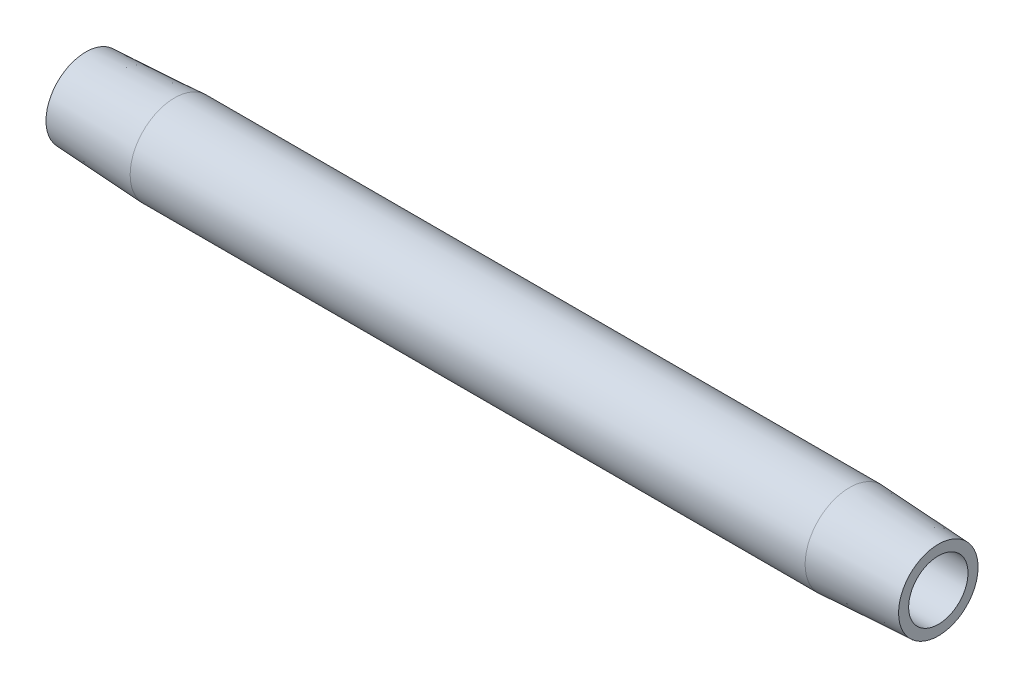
ISO-10303-21;
HEADER;
FILE_DESCRIPTION(('STEP AP214'),'2;1');
FILE_NAME('part.step','',(''),(''),'','','');
FILE_SCHEMA(('AUTOMOTIVE_DESIGN { 1 0 10303 214 1 1 1 1 }'));
ENDSEC;
DATA;
#1=APPLICATION_CONTEXT('core data for automotive mechanical design processes');
#2=APPLICATION_PROTOCOL_DEFINITION('international standard','automotive_design',2000,#1);
#3=PRODUCT_CONTEXT('',#1,'mechanical');
#4=PRODUCT('Part','Part','',(#3));
#5=PRODUCT_RELATED_PRODUCT_CATEGORY('part','',(#4));
#6=PRODUCT_DEFINITION_FORMATION('','',#4);
#7=PRODUCT_DEFINITION_CONTEXT('part definition',#1,'design');
#8=PRODUCT_DEFINITION('design','',#6,#7);
#9=PRODUCT_DEFINITION_SHAPE('','',#8);
#10=(LENGTH_UNIT() NAMED_UNIT(*) SI_UNIT(.MILLI.,.METRE.));
#11=(NAMED_UNIT(*) PLANE_ANGLE_UNIT() SI_UNIT($,.RADIAN.));
#12=(NAMED_UNIT(*) SI_UNIT($,.STERADIAN.) SOLID_ANGLE_UNIT());
#13=UNCERTAINTY_MEASURE_WITH_UNIT(LENGTH_MEASURE(1.E-05),#10,'distance_accuracy_value','');
#14=(GEOMETRIC_REPRESENTATION_CONTEXT(3) GLOBAL_UNCERTAINTY_ASSIGNED_CONTEXT((#13)) GLOBAL_UNIT_ASSIGNED_CONTEXT((#10,
#11,#12)) REPRESENTATION_CONTEXT('',''));
#15=CARTESIAN_POINT('',(0.,0.,0.));
#16=DIRECTION('',(0.,0.,1.));
#17=DIRECTION('',(1.,0.,0.));
#18=AXIS2_PLACEMENT_3D('',#15,#16,#17);
#19=CARTESIAN_POINT('',(0.476141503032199,0.,0.));
#20=DIRECTION('',(-1.,0.,0.));
#21=DIRECTION('',(0.,0.,1.));
#22=AXIS2_PLACEMENT_3D('',#19,#20,#21);
#23=CYLINDRICAL_SURFACE('',#22,3.96875);
#24=CARTESIAN_POINT('',(7.9375,0.,0.));
#25=DIRECTION('',(-1.,0.,0.));
#26=DIRECTION('',(0.,0.,1.));
#27=AXIS2_PLACEMENT_3D('',#24,#25,#26);
#28=CIRCLE('',#27,3.96875);
#29=CARTESIAN_POINT('',(7.9375,0.,3.96875));
#30=VERTEX_POINT('',#29);
#31=EDGE_CURVE('E10',#30,#30,#28,.T.);
#32=ORIENTED_EDGE('',*,*,#31,.F.);
#33=EDGE_LOOP('',(#32));
#34=FACE_BOUND('',#33,.T.);
#35=CARTESIAN_POINT('',(68.2625,0.,0.));
#36=DIRECTION('',(-1.,0.,0.));
#37=DIRECTION('',(0.,0.,1.));
#38=AXIS2_PLACEMENT_3D('',#35,#36,#37);
#39=CIRCLE('',#38,3.96875);
#40=CARTESIAN_POINT('',(68.2625,0.,3.96875));
#41=VERTEX_POINT('',#40);
#42=EDGE_CURVE('E52',#41,#41,#39,.T.);
#43=ORIENTED_EDGE('',*,*,#42,.T.);
#44=EDGE_LOOP('',(#43));
#45=FACE_BOUND('',#44,.T.);
#46=ADVANCED_FACE('F30',(#34,#45),#23,.T.);
#47=CARTESIAN_POINT('',(7.9375,0.,0.));
#48=DIRECTION('',(1.,0.,0.));
#49=DIRECTION('',(0.,0.,-1.));
#50=AXIS2_PLACEMENT_3D('',#47,#48,#49);
#51=CONICAL_SURFACE('',#50,3.96875,0.0523598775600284);
#52=CARTESIAN_POINT('',(0.,0.,0.));
#53=DIRECTION('',(-1.,0.,0.));
#54=DIRECTION('',(0.,0.,1.));
#55=AXIS2_PLACEMENT_3D('',#52,#53,#54);
#56=CIRCLE('',#55,3.55276325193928);
#57=CARTESIAN_POINT('',(0.,0.,3.55276325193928));
#58=VERTEX_POINT('',#57);
#59=EDGE_CURVE('E36',#58,#58,#56,.T.);
#60=ORIENTED_EDGE('',*,*,#59,.F.);
#61=EDGE_LOOP('',(#60));
#62=FACE_BOUND('',#61,.T.);
#63=ORIENTED_EDGE('',*,*,#31,.T.);
#64=EDGE_LOOP('',(#63));
#65=FACE_BOUND('',#64,.T.);
#66=ADVANCED_FACE('F77',(#62,#65),#51,.T.);
#67=CARTESIAN_POINT('',(0.,3.55276325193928,0.));
#68=DIRECTION('',(1.,0.,0.));
#69=DIRECTION('',(0.,0.,-1.));
#70=AXIS2_PLACEMENT_3D('',#67,#68,#69);
#71=PLANE('',#70);
#72=CARTESIAN_POINT('',(0.,0.,0.));
#73=DIRECTION('',(-1.,0.,0.));
#74=DIRECTION('',(0.,0.,1.));
#75=AXIS2_PLACEMENT_3D('',#72,#73,#74);
#76=CIRCLE('',#75,2.65429999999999);
#77=CARTESIAN_POINT('',(0.,0.,2.65429999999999));
#78=VERTEX_POINT('',#77);
#79=EDGE_CURVE('E40',#78,#78,#76,.T.);
#80=ORIENTED_EDGE('',*,*,#79,.F.);
#81=EDGE_LOOP('',(#80));
#82=FACE_BOUND('',#81,.T.);
#83=ORIENTED_EDGE('',*,*,#59,.T.);
#84=EDGE_LOOP('',(#83));
#85=FACE_BOUND('',#84,.T.);
#86=ADVANCED_FACE('F72',(#82,#85),#71,.F.);
#87=CARTESIAN_POINT('',(0.476141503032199,0.,0.));
#88=DIRECTION('',(-1.,0.,0.));
#89=DIRECTION('',(0.,0.,1.));
#90=AXIS2_PLACEMENT_3D('',#87,#88,#89);
#91=CYLINDRICAL_SURFACE('',#90,2.6543);
#92=CARTESIAN_POINT('',(76.2,0.,0.));
#93=DIRECTION('',(-1.,0.,0.));
#94=DIRECTION('',(0.,0.,1.));
#95=AXIS2_PLACEMENT_3D('',#92,#93,#94);
#96=CIRCLE('',#95,2.6543);
#97=CARTESIAN_POINT('',(76.2,0.,2.6543));
#98=VERTEX_POINT('',#97);
#99=EDGE_CURVE('E44',#98,#98,#96,.T.);
#100=ORIENTED_EDGE('',*,*,#99,.F.);
#101=EDGE_LOOP('',(#100));
#102=FACE_BOUND('',#101,.T.);
#103=ORIENTED_EDGE('',*,*,#79,.T.);
#104=EDGE_LOOP('',(#103));
#105=FACE_BOUND('',#104,.T.);
#106=ADVANCED_FACE('F66',(#102,#105),#91,.F.);
#107=CARTESIAN_POINT('',(76.2,2.6543,0.));
#108=DIRECTION('',(-1.,0.,0.));
#109=DIRECTION('',(0.,0.,1.));
#110=AXIS2_PLACEMENT_3D('',#107,#108,#109);
#111=PLANE('',#110);
#112=CARTESIAN_POINT('',(76.2,0.,0.));
#113=DIRECTION('',(-1.,0.,0.));
#114=DIRECTION('',(0.,0.,1.));
#115=AXIS2_PLACEMENT_3D('',#112,#113,#114);
#116=CIRCLE('',#115,3.55276325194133);
#117=CARTESIAN_POINT('',(76.2,0.,3.55276325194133));
#118=VERTEX_POINT('',#117);
#119=EDGE_CURVE('E49',#118,#118,#116,.T.);
#120=ORIENTED_EDGE('',*,*,#119,.F.);
#121=EDGE_LOOP('',(#120));
#122=FACE_BOUND('',#121,.T.);
#123=ORIENTED_EDGE('',*,*,#99,.T.);
#124=EDGE_LOOP('',(#123));
#125=FACE_BOUND('',#124,.T.);
#126=ADVANCED_FACE('F60',(#122,#125),#111,.F.);
#127=CARTESIAN_POINT('',(76.2,0.,0.));
#128=DIRECTION('',(-1.,0.,0.));
#129=DIRECTION('',(0.,0.,1.));
#130=AXIS2_PLACEMENT_3D('',#127,#128,#129);
#131=CONICAL_SURFACE('',#130,3.55276325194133,0.0523598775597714);
#132=ORIENTED_EDGE('',*,*,#42,.F.);
#133=EDGE_LOOP('',(#132));
#134=FACE_BOUND('',#133,.T.);
#135=ORIENTED_EDGE('',*,*,#119,.T.);
#136=EDGE_LOOP('',(#135));
#137=FACE_BOUND('',#136,.T.);
#138=ADVANCED_FACE('F57',(#134,#137),#131,.T.);
#139=CLOSED_SHELL('',(#46,#66,#86,#106,#126,#138));
#140=MANIFOLD_SOLID_BREP('B2',#139);
#141=ADVANCED_BREP_SHAPE_REPRESENTATION('',(#18,#140),#14);
#142=SHAPE_DEFINITION_REPRESENTATION(#9,#141);
ENDSEC;
END-ISO-10303-21;
